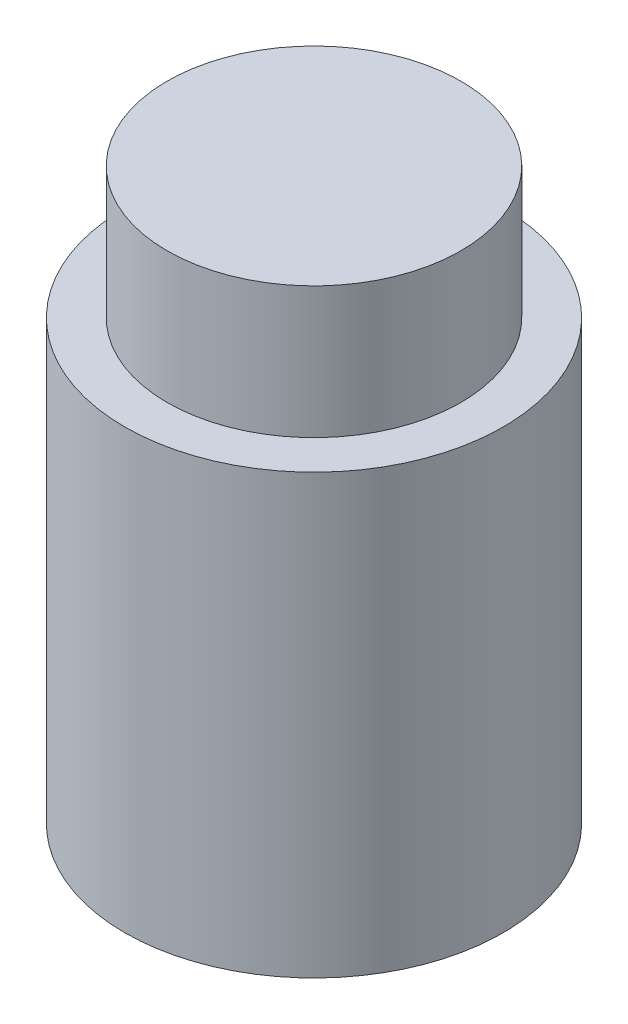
from build123d import *

# Parameters (mm, degrees)
SKETCH1_R           = 10.8
BOSS_EXTRUDE1_DEPTH = 25
SKETCH2_R           = 8.384707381
BOSS_EXTRUDE2_DEPTH = 7.5


with BuildPart() as part:
    # Sketch1 → Boss-Extrude1 (new body)
    with BuildSketch(Plane(origin=(0, 0, 0), x_dir=(1, 0, 0), z_dir=(0, 1, 0))):
        with Locations(Location((0, 0, 0), (0, 0, 270))):
            Circle(SKETCH1_R)
    extrude(amount=BOSS_EXTRUDE1_DEPTH)

    # Sketch2 → Boss-Extrude2 (add)
    with BuildSketch(Plane(origin=(0, 25, 0), x_dir=(1, 0, 0), z_dir=(0, 1, 0))):
        with Locations(Location((0, 0, 0), (0, 0, 270))):
            Circle(SKETCH2_R)
    extrude(amount=BOSS_EXTRUDE2_DEPTH)


solid = part.part
